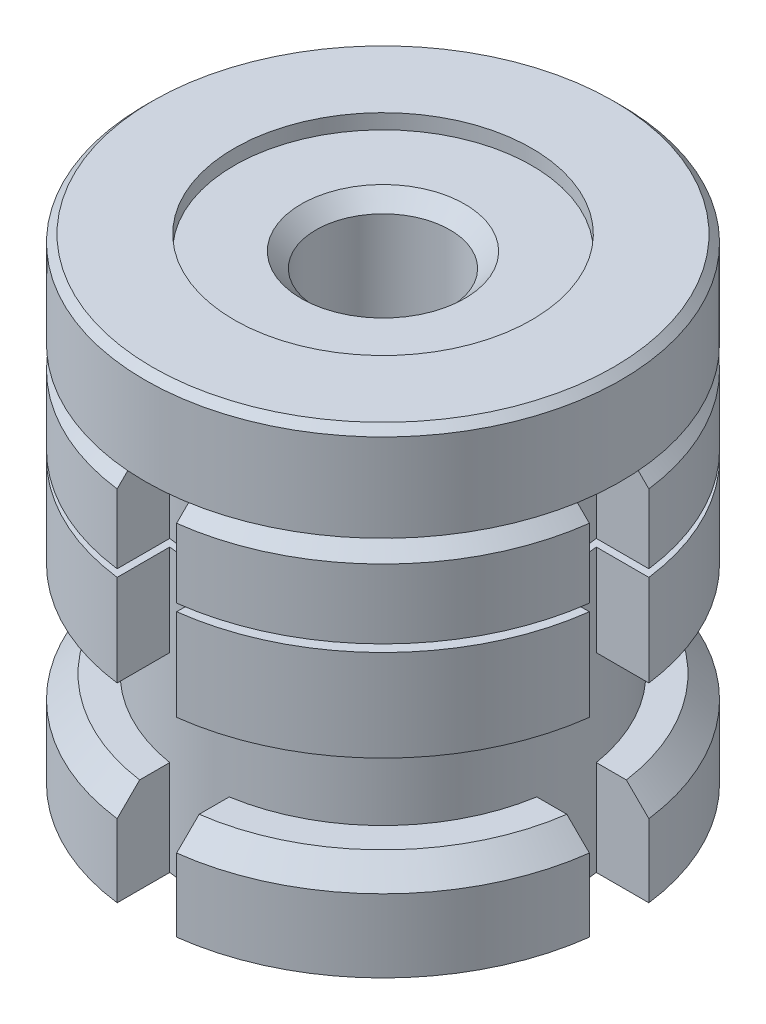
from build123d import *
from build123d.topology import SkipClean

# Parameters (mm, degrees)
SKETCH1_R           = 16
BOSS_EXTRUDE1_DEPTH = 12.8
SKETCH2_W           = 6
SKETCH2_H           = 0.5
SKETCH3_R           = 12.5
BOSS_EXTRUDE2_DEPTH = 12.8
SKETCH4_R           = 16
BOSS_EXTRUDE3_DEPTH = 6.4
CUT_EXTRUDE4_START  = -25.6
CUT_EXTRUDE4_DEPTH  = 25.6
CHAMFER1_SIZE       = 1.5
SKETCH6_R           = 16
BOSS_EXTRUDE4_DEPTH = 6.4
CHAMFER2_SIZE       = 0.5
CUT_EXTRUDE5_START  = -1
SKETCH7_R           = 10
CUT_EXTRUDE5_DEPTH  = 1
SKETCH8_R           = 4.5
CUT_EXTRUDE6_DEPTH  = 31
CHAMFER3_SIZE       = 1


with BuildPart() as part:
    # Sketch1 → Boss-Extrude1 (new body)
    with BuildSketch(Plane(origin=(0, 0, 0), x_dir=(1, 0, 0), z_dir=(0, 1, 0))):
        with Locations(Location((0, 0, 0), (0, 0, 270))):
            Circle(SKETCH1_R)
    extrude(amount=BOSS_EXTRUDE1_DEPTH)

    # Sketch2 → Cut-Revolve1 (revolve, cut)
    with BuildSketch(Plane(origin=(0, 0, 0), x_dir=(0, 0, -1), z_dir=(1, 0, 0))):
        with Locations((-13, 6.4)):
            Rectangle(SKETCH2_W, SKETCH2_H)
    revolve(axis=Axis((0, 13.26477, 0), (0, -1, 0)), mode=Mode.SUBTRACT)

    # Sketch3 → Boss-Extrude2 (add)
    with BuildSketch(Plane.XZ):
        with Locations(Location((0, 0, 0), (0, 0, 270))):
            Circle(SKETCH3_R)
    extrude(amount=BOSS_EXTRUDE2_DEPTH)

    # Sketch4 → Boss-Extrude3 (add)
    with BuildSketch(Plane.XZ.offset(12.8)):
        with Locations(Location((0, 0, 0), (0, 0, 90))):
            Circle(SKETCH4_R)
    extrude(amount=-BOSS_EXTRUDE3_DEPTH)

    # Sketch5 → Cut-Extrude4 (cut)
    with SkipClean():  # the faces are left unmerged after this step: merging them gives an invalid solid
        with BuildSketch(Plane(origin=(0, 12.8, 0), x_dir=(1, 0, 0), z_dir=(0, 1, 0)).offset(CUT_EXTRUDE4_START)):
            with BuildLine():
                Line((-15.874508, 2), (-12.338963, 2))
                ThreePointArc((-12.338963, 2), (-12.5, 0), (-12.338963, -2))
                Line((-12.338963, -2), (-15.874508, -2))
                ThreePointArc((-15.874508, -2), (-16, 0), (-15.874508, 2))
            make_face()
            with BuildLine():
                Line((-2, 15.874508), (-2, 12.338963))
                ThreePointArc((-2, 12.338963), (0, 12.5), (2, 12.338963))
                Line((2, 12.338963), (2, 15.874508))
                ThreePointArc((2, 15.874508), (0, 16), (-2, 15.874508))
            make_face()
            with BuildLine():
                Line((12.338963, 2), (15.874508, 2))
                ThreePointArc((15.874508, 2), (16, 0), (15.874508, -2))
                Line((15.874508, -2), (12.338963, -2))
                ThreePointArc((12.338963, -2), (12.5, 0), (12.338963, 2))
            make_face()
            with BuildLine():
                Line((-2, -12.338963), (-2, -15.874508))
                ThreePointArc((-2, -15.874508), (0, -16), (2, -15.874508))
                Line((2, -15.874508), (2, -12.338963))
                ThreePointArc((2, -12.338963), (0, -12.5), (-2, -12.338963))
            make_face()
        extrude(amount=CUT_EXTRUDE4_DEPTH, mode=Mode.SUBTRACT)

    # Chamfer1
    chamfer1_edges = [part.edges().sort_by_distance(p)[0] for p in [
        (11.313708, -6.4, -11.313708),
        (11.313708, -6.4, 11.313708),
        (-11.313708, -6.4, 11.313708),
        (-11.313708, -6.4, -11.313708),
        (11.313708, 12.8, 11.313708),
        (11.313708, 12.8, -11.313708),
        (-11.313708, 12.8, -11.313708),
        (-11.313708, 12.8, 11.313708),
    ]]
    chamfer(chamfer1_edges, length=CHAMFER1_SIZE)

    # Sketch6 → Boss-Extrude4 (add)
    with BuildSketch(Plane(origin=(0, 12.8, 0), x_dir=(1, 0, 0), z_dir=(0, 1, 0))):
        with Locations(Location((0, 0, 0), (0, 0, 270))):
            Circle(SKETCH6_R)
    extrude(amount=BOSS_EXTRUDE4_DEPTH)

    # Chamfer2
    chamfer2_edges = [part.edges().sort_by_distance(p)[0] for p in [
        (0, 19.2, -16),
    ]]
    chamfer(chamfer2_edges, length=CHAMFER2_SIZE)

    # Sketch7 → Cut-Extrude5 (cut)
    with BuildSketch(Plane(origin=(0, 19.2, 0), x_dir=(1, 0, 0), z_dir=(0, 1, 0)).offset(CUT_EXTRUDE5_START)):
        with Locations(Location((0, 0, 0), (0, 0, 270))):
            Circle(SKETCH7_R)
    extrude(amount=CUT_EXTRUDE5_DEPTH, mode=Mode.SUBTRACT)

    # Sketch8 → Cut-Extrude6 (cut)
    with BuildSketch(Plane(origin=(0, 18.2, 0), x_dir=(1, 0, 0), z_dir=(0, 1, 0))):
        with Locations(Location((0, 0, 0), (0, 0, 270))):
            Circle(SKETCH8_R)
    extrude(amount=-CUT_EXTRUDE6_DEPTH, mode=Mode.SUBTRACT)

    # Chamfer3
    chamfer3_edges = [part.edges().sort_by_distance(p)[0] for p in [
        (0, 18.2, -4.5),
        (0, -12.8, -4.5),
    ]]
    chamfer(chamfer3_edges, length=CHAMFER3_SIZE)


solid = part.part
